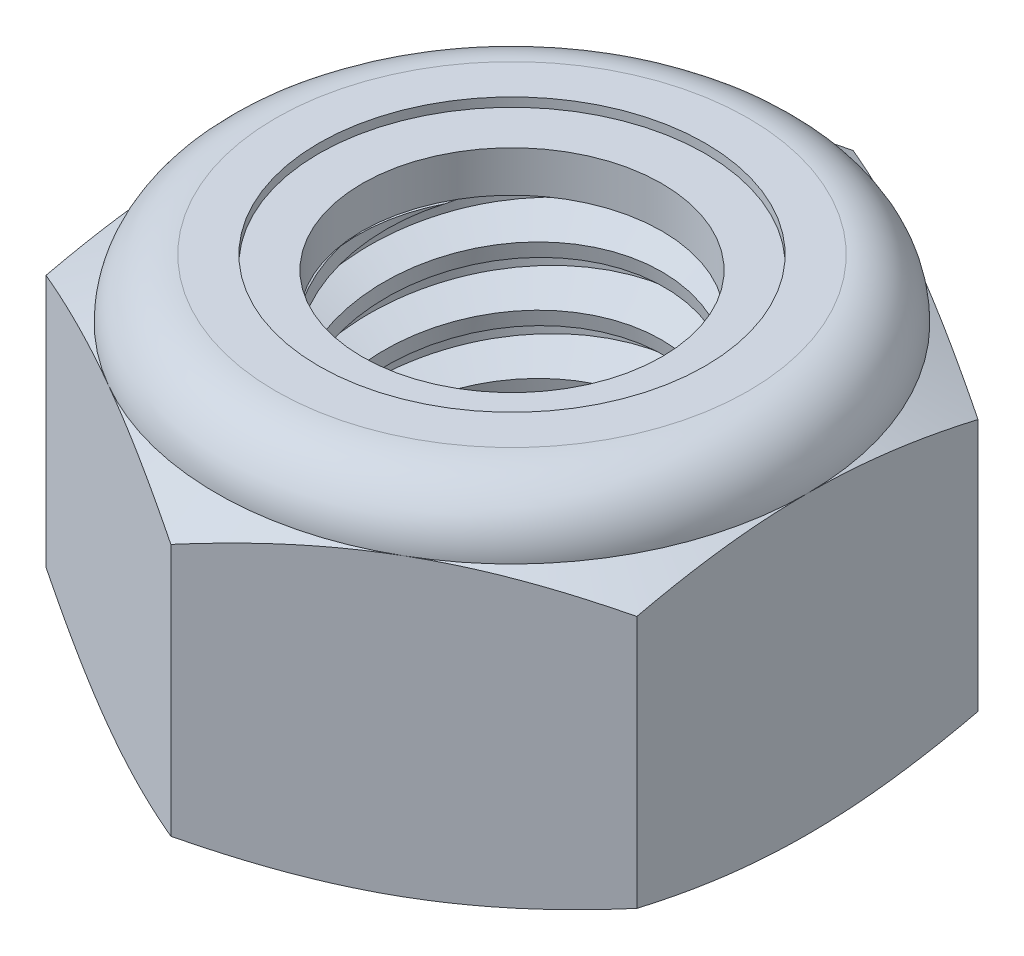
from build123d import *

# Parameters (mm, degrees)
EXTRUDE1_DEPTH      = 6
SKETCH2_W           = 3
SKETCH2_H           = 6
LPATTERN1_COUNT     = 6
LPATTERN1_PITCH     = 1
LPATTERN1_COL_COUNT = 2
LPATTERN1_COL_PITCH = 1


with BuildPart() as part:
    # Sketch1 → Extrude1 (new body)
    with BuildSketch(Plane(origin=(0, 0, 0), x_dir=(1, 0, 0), z_dir=(0, 1, 0))):
        Polygon((0, 5.773502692), (-5, 2.886751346), (-5, -2.886751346), (0, -5.773502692), (5, -2.886751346), (5, 2.886751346), align=None)
    extrude(amount=EXTRUDE1_DEPTH)

    # Sketch4 → Cut-Revolve2 (revolve, cut)
    with BuildSketch(Plane(origin=(0, 0, 0), x_dir=(0, 0, -1), z_dir=(1, 0, 0)), mode=Mode.PRIVATE) as cut_revolve2_sk:
        Polygon((0, 6), (3, 6), (2.538023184, 5.784576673), (2.538023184, 0.215423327), (3, 0), (0, 0), align=None)
    revolve(cut_revolve2_sk.sketch.rotate(Axis((0, 6, 0), (0, 1, 0)), 55.157981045), axis=Axis((0, 6, 0), (0, 1, 0)), mode=Mode.SUBTRACT)


with BuildPart() as body_2:
    # Sketch2 → Revolve1 (revolve)
    with BuildSketch(Plane(origin=(0, 0, 0), x_dir=(0, 0, -1), z_dir=(1, 0, 0))):
        with Locations((1.5, 3)):
            Rectangle(SKETCH2_W, SKETCH2_H)
    revolve(axis=Axis((0, -3, 0), (0, 1, 0)))

    # Sketch3 → Cut-Revolve1 (revolve, cut)
    with BuildSketch(Plane(origin=(0, 0, 0), x_dir=(0, 0, -1), z_dir=(1, 0, 0)), mode=Mode.PRIVATE) as cut_revolve1_sk:
        Polygon((3.020549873, 5.87670076), (3.164398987, 5.013606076), (2.579122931, 5.232870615), (2.538023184, 5.479469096), align=None)
    cut_revolve1 = revolve(cut_revolve1_sk.sketch.rotate(Axis((0, 6, 0.178376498), (0, -0.9863939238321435, -0.1643989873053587)), 180), axis=Axis((0, 6, 0.178376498), (0, -0.9863939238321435, -0.1643989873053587)), mode=Mode.SUBTRACT)

    # LPattern1: Cut-Revolve1 ×6
    with Locations(*[(0, -i * LPATTERN1_PITCH, 0) for i in range(1, LPATTERN1_COUNT)]):
        add(cut_revolve1, mode=Mode.SUBTRACT)

    # LPattern1 col: Cut-Revolve1 ×2
    with Locations(*[(0, i * LPATTERN1_COL_PITCH, 0) for i in range(1, LPATTERN1_COL_COUNT)]):
        add(cut_revolve1, mode=Mode.SUBTRACT)


with BuildPart() as part_1:
    add(part.part)

    # Combine1: cut body 2
    add(body_2.part, mode=Mode.SUBTRACT)

    # Sketch5 → Cut-Revolve3 (revolve, cut)
    with BuildSketch(Plane(origin=(0, 0, 0), x_dir=(0, 0, -1), z_dir=(1, 0, 0)), mode=Mode.PRIVATE) as cut_revolve3_sk:
        with BuildLine():
            Line((0, 0), (5, 0))
            Line((5, 0), (5.773502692, 0.360690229))
            Line((5.773502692, 0.360690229), (5.773502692, 4.639309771))
            Line((5.773502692, 4.639309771), (5, 5))
            ThreePointArc((5, 5), (4.707106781, 5.707106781), (4, 6))
            Line((4, 6), (4, 7.27))
            Line((4, 7.27), (7.043502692, 7.27))
            Line((7.043502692, 7.27), (7.043502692, -1.27))
            Line((7.043502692, -1.27), (0, -1.27))
            Line((0, -1.27), (0, 0))
        make_face()
    revolve(cut_revolve3_sk.sketch.rotate(Axis((0, 0, 0), (0, 1, 0)), 55.157981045), axis=Axis((0, 0, 0), (0, 1, 0)), mode=Mode.SUBTRACT)

    # Sketch6 → Cut-Revolve4 (revolve, cut)
    with BuildSketch(Plane(origin=(0, 0, 0), x_dir=(0, 0, -1), z_dir=(1, 0, 0)), mode=Mode.PRIVATE) as cut_revolve4_sk:
        with BuildLine():
            Line((0, 5), (4.8476, 5))
            ThreePointArc((4.8476, 5), (4.599343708, 5.599343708), (4, 5.8476))
            Line((4, 5.8476), (3.269011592, 5.8476))
            Line((3.269011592, 5.8476), (3.269011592, 7.27))
            Line((3.269011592, 7.27), (0, 7.27))
            Line((0, 7.27), (0, 5))
        make_face()
    revolve(cut_revolve4_sk.sketch.rotate(Axis((0, 7.27, 0), (0, 1, 0)), 32.153394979), axis=Axis((0, 7.27, 0), (0, 1, 0)), mode=Mode.SUBTRACT)


with BuildPart() as body_2_2:
    # Sketch7 → Revolve2 (revolve)
    with BuildSketch(Plane(origin=(0, 0, 0), x_dir=(0, 0, -1), z_dir=(1, 0, 0))):
        with BuildLine():
            Line((2.538023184, 5.0762), (4.767627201, 5.0762))
            ThreePointArc((4.767627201, 5.0762), (4.51782105, 5.57176859), (4, 5.7714))
            Line((4, 5.7714), (2.538023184, 5.7714))
            Line((2.538023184, 5.7714), (2.538023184, 5.0762))
        make_face()
    revolve(axis=Axis((0, 5.0762, 0), (0, 1, 0)))


solid = Compound([part_1.part, body_2_2.part])
